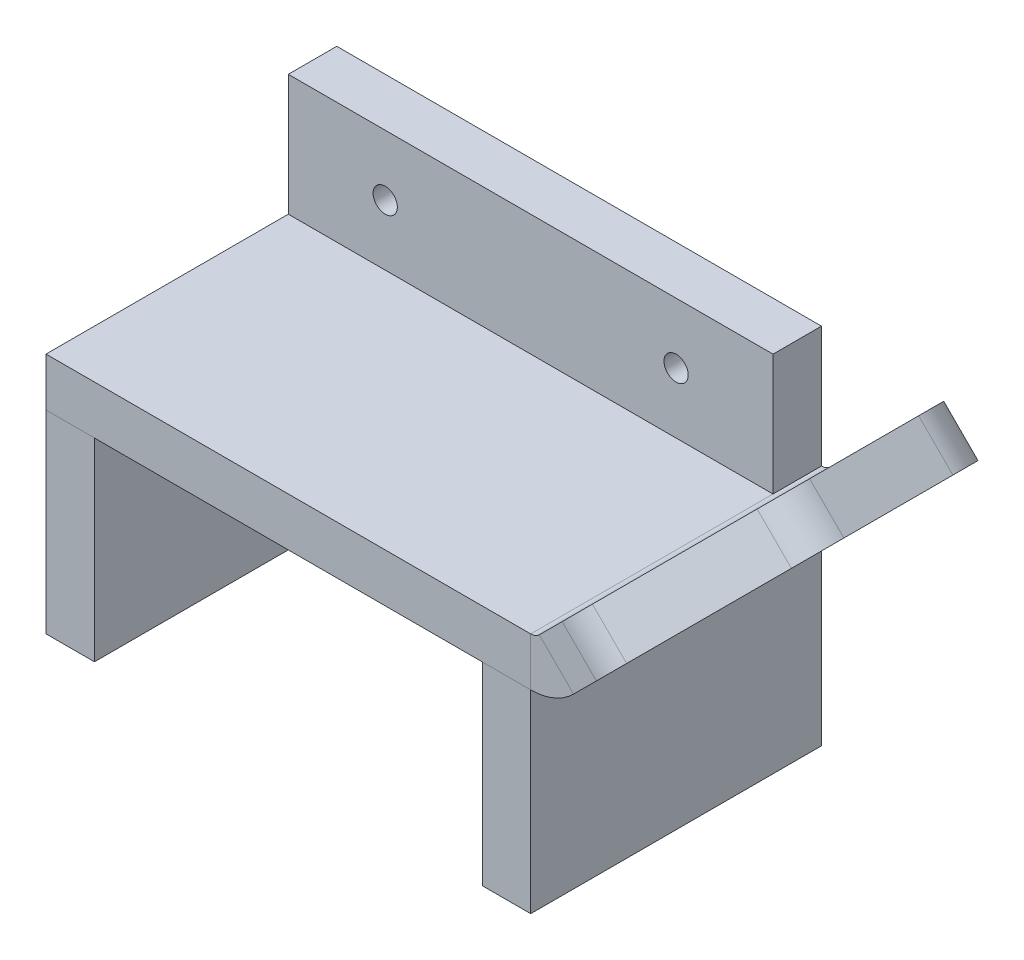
ISO-10303-21;
HEADER;
FILE_DESCRIPTION(('STEP AP214'),'2;1');
FILE_NAME('part.step','',(''),(''),'','','');
FILE_SCHEMA(('AUTOMOTIVE_DESIGN { 1 0 10303 214 1 1 1 1 }'));
ENDSEC;
DATA;
#1=APPLICATION_CONTEXT('core data for automotive mechanical design processes');
#2=APPLICATION_PROTOCOL_DEFINITION('international standard','automotive_design',2000,#1);
#3=PRODUCT_CONTEXT('',#1,'mechanical');
#4=PRODUCT('Part','Part','',(#3));
#5=PRODUCT_RELATED_PRODUCT_CATEGORY('part','',(#4));
#6=PRODUCT_DEFINITION_FORMATION('','',#4);
#7=PRODUCT_DEFINITION_CONTEXT('part definition',#1,'design');
#8=PRODUCT_DEFINITION('design','',#6,#7);
#9=PRODUCT_DEFINITION_SHAPE('','',#8);
#10=(LENGTH_UNIT() NAMED_UNIT(*) SI_UNIT(.MILLI.,.METRE.));
#11=(NAMED_UNIT(*) PLANE_ANGLE_UNIT() SI_UNIT($,.RADIAN.));
#12=(NAMED_UNIT(*) SI_UNIT($,.STERADIAN.) SOLID_ANGLE_UNIT());
#13=UNCERTAINTY_MEASURE_WITH_UNIT(LENGTH_MEASURE(1.E-05),#10,'distance_accuracy_value','');
#14=(GEOMETRIC_REPRESENTATION_CONTEXT(3) GLOBAL_UNCERTAINTY_ASSIGNED_CONTEXT((#13)) GLOBAL_UNIT_ASSIGNED_CONTEXT((#10,
#11,#12)) REPRESENTATION_CONTEXT('',''));
#15=CARTESIAN_POINT('',(0.,0.,0.));
#16=DIRECTION('',(0.,0.,1.));
#17=DIRECTION('',(1.,0.,0.));
#18=AXIS2_PLACEMENT_3D('',#15,#16,#17);
#19=CARTESIAN_POINT('',(63.2743596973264,1187.45,-76.2));
#20=DIRECTION('',(-1.,0.,0.));
#21=DIRECTION('',(0.,0.,1.));
#22=AXIS2_PLACEMENT_3D('',#19,#20,#21);
#23=PLANE('',#22);
#24=DIRECTION('',(0.,0.,-1.));
#25=VECTOR('',#24,1.);
#26=CARTESIAN_POINT('',(63.2743596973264,1155.7,-76.2));
#27=LINE('',#26,#25);
#28=CARTESIAN_POINT('',(63.2743596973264,1155.7,-63.5));
#29=VERTEX_POINT('',#28);
#30=CARTESIAN_POINT('',(63.2743596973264,1155.7,-76.2));
#31=VERTEX_POINT('',#30);
#32=EDGE_CURVE('E124',#29,#31,#27,.T.);
#33=ORIENTED_EDGE('',*,*,#32,.T.);
#34=DIRECTION('',(0.,-1.,0.));
#35=VECTOR('',#34,1.);
#36=CARTESIAN_POINT('',(63.2743596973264,1187.45,-76.2));
#37=LINE('',#36,#35);
#38=CARTESIAN_POINT('',(63.2743596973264,1187.45,-76.2));
#39=VERTEX_POINT('',#38);
#40=EDGE_CURVE('E12',#39,#31,#37,.T.);
#41=ORIENTED_EDGE('',*,*,#40,.F.);
#42=DIRECTION('',(0.,0.,-1.));
#43=VECTOR('',#42,1.);
#44=CARTESIAN_POINT('',(63.2743596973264,1187.45,-76.2));
#45=LINE('',#44,#43);
#46=CARTESIAN_POINT('',(63.2743596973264,1187.45,-63.5));
#47=VERTEX_POINT('',#46);
#48=EDGE_CURVE('E111',#47,#39,#45,.T.);
#49=ORIENTED_EDGE('',*,*,#48,.F.);
#50=DIRECTION('',(0.,-1.,0.));
#51=VECTOR('',#50,1.);
#52=CARTESIAN_POINT('',(63.2743596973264,1187.45,-63.5));
#53=LINE('',#52,#51);
#54=EDGE_CURVE('E120',#47,#29,#53,.T.);
#55=ORIENTED_EDGE('',*,*,#54,.T.);
#56=EDGE_LOOP('',(#33,#41,#49,#55));
#57=FACE_BOUND('',#56,.T.);
#58=ADVANCED_FACE('F58',(#57),#23,.F.);
#59=CARTESIAN_POINT('',(63.2743596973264,1187.45,-76.2));
#60=DIRECTION('',(0.,0.,1.));
#61=DIRECTION('',(1.,0.,0.));
#62=AXIS2_PLACEMENT_3D('',#59,#60,#61);
#63=PLANE('',#62);
#64=CARTESIAN_POINT('',(37.8743596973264,1171.575,-76.2));
#65=DIRECTION('',(0.,0.,-1.));
#66=DIRECTION('',(-1.,0.,0.));
#67=AXIS2_PLACEMENT_3D('',#64,#65,#66);
#68=CIRCLE('',#67,3.17500000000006);
#69=CARTESIAN_POINT('',(34.6993596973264,1171.575,-76.2));
#70=VERTEX_POINT('',#69);
#71=EDGE_CURVE('E133',#70,#70,#68,.T.);
#72=ORIENTED_EDGE('',*,*,#71,.F.);
#73=EDGE_LOOP('',(#72));
#74=FACE_BOUND('',#73,.T.);
#75=CARTESIAN_POINT('',(-38.354,1171.575,-76.2));
#76=DIRECTION('',(0.,0.,-1.));
#77=DIRECTION('',(-1.,0.,0.));
#78=AXIS2_PLACEMENT_3D('',#75,#76,#77);
#79=CIRCLE('',#78,3.17500000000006);
#80=CARTESIAN_POINT('',(-41.5290000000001,1171.575,-76.2));
#81=VERTEX_POINT('',#80);
#82=EDGE_CURVE('E138',#81,#81,#79,.T.);
#83=ORIENTED_EDGE('',*,*,#82,.F.);
#84=EDGE_LOOP('',(#83));
#85=FACE_BOUND('',#84,.T.);
#86=DIRECTION('',(-1.,0.,0.));
#87=VECTOR('',#86,1.);
#88=CARTESIAN_POINT('',(63.2743596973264,1155.7,-76.2));
#89=LINE('',#88,#87);
#90=CARTESIAN_POINT('',(-63.754,1155.7,-76.2));
#91=VERTEX_POINT('',#90);
#92=EDGE_CURVE('E115',#31,#91,#89,.T.);
#93=ORIENTED_EDGE('',*,*,#92,.T.);
#94=DIRECTION('',(0.,-1.,0.));
#95=VECTOR('',#94,1.);
#96=CARTESIAN_POINT('',(-63.754,1187.45,-76.2));
#97=LINE('',#96,#95);
#98=CARTESIAN_POINT('',(-63.754,1187.45,-76.2));
#99=VERTEX_POINT('',#98);
#100=EDGE_CURVE('E67',#99,#91,#97,.T.);
#101=ORIENTED_EDGE('',*,*,#100,.F.);
#102=DIRECTION('',(-1.,0.,0.));
#103=VECTOR('',#102,1.);
#104=CARTESIAN_POINT('',(63.2743596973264,1187.45,-76.2));
#105=LINE('',#104,#103);
#106=EDGE_CURVE('E106',#39,#99,#105,.T.);
#107=ORIENTED_EDGE('',*,*,#106,.F.);
#108=ORIENTED_EDGE('',*,*,#40,.T.);
#109=EDGE_LOOP('',(#93,#101,#107,#108));
#110=FACE_BOUND('',#109,.T.);
#111=ADVANCED_FACE('F114',(#74,#85,#110),#63,.F.);
#112=CARTESIAN_POINT('',(-63.754,1187.45,-76.2));
#113=DIRECTION('',(1.,0.,0.));
#114=DIRECTION('',(0.,0.,-1.));
#115=AXIS2_PLACEMENT_3D('',#112,#113,#114);
#116=PLANE('',#115);
#117=DIRECTION('',(0.,0.,1.));
#118=VECTOR('',#117,1.);
#119=CARTESIAN_POINT('',(-63.754,1155.7,-76.2));
#120=LINE('',#119,#118);
#121=CARTESIAN_POINT('',(-63.754,1155.7,-63.5));
#122=VERTEX_POINT('',#121);
#123=EDGE_CURVE('E93',#91,#122,#120,.T.);
#124=ORIENTED_EDGE('',*,*,#123,.T.);
#125=DIRECTION('',(0.,-1.,0.));
#126=VECTOR('',#125,1.);
#127=CARTESIAN_POINT('',(-63.754,1187.45,-63.5));
#128=LINE('',#127,#126);
#129=CARTESIAN_POINT('',(-63.754,1187.45,-63.5));
#130=VERTEX_POINT('',#129);
#131=EDGE_CURVE('E116',#130,#122,#128,.T.);
#132=ORIENTED_EDGE('',*,*,#131,.F.);
#133=DIRECTION('',(0.,0.,1.));
#134=VECTOR('',#133,1.);
#135=CARTESIAN_POINT('',(-63.754,1187.45,-76.2));
#136=LINE('',#135,#134);
#137=EDGE_CURVE('E109',#99,#130,#136,.T.);
#138=ORIENTED_EDGE('',*,*,#137,.F.);
#139=ORIENTED_EDGE('',*,*,#100,.T.);
#140=EDGE_LOOP('',(#124,#132,#138,#139));
#141=FACE_BOUND('',#140,.T.);
#142=ADVANCED_FACE('F118',(#141),#116,.F.);
#143=CARTESIAN_POINT('',(63.2743596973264,1187.45,-63.5));
#144=DIRECTION('',(0.,0.,-1.));
#145=DIRECTION('',(-1.,0.,0.));
#146=AXIS2_PLACEMENT_3D('',#143,#144,#145);
#147=PLANE('',#146);
#148=CARTESIAN_POINT('',(37.8743596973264,1171.575,-63.5));
#149=DIRECTION('',(0.,0.,-1.));
#150=DIRECTION('',(-1.,0.,0.));
#151=AXIS2_PLACEMENT_3D('',#148,#149,#150);
#152=CIRCLE('',#151,3.17500000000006);
#153=CARTESIAN_POINT('',(34.6993596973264,1171.575,-63.5));
#154=VERTEX_POINT('',#153);
#155=EDGE_CURVE('E61',#154,#154,#152,.T.);
#156=ORIENTED_EDGE('',*,*,#155,.T.);
#157=EDGE_LOOP('',(#156));
#158=FACE_BOUND('',#157,.T.);
#159=CARTESIAN_POINT('',(-38.354,1171.575,-63.5));
#160=DIRECTION('',(0.,0.,-1.));
#161=DIRECTION('',(-1.,0.,0.));
#162=AXIS2_PLACEMENT_3D('',#159,#160,#161);
#163=CIRCLE('',#162,3.17500000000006);
#164=CARTESIAN_POINT('',(-41.5290000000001,1171.575,-63.5));
#165=VERTEX_POINT('',#164);
#166=EDGE_CURVE('E131',#165,#165,#163,.T.);
#167=ORIENTED_EDGE('',*,*,#166,.T.);
#168=EDGE_LOOP('',(#167));
#169=FACE_BOUND('',#168,.T.);
#170=DIRECTION('',(1.,0.,0.));
#171=VECTOR('',#170,1.);
#172=CARTESIAN_POINT('',(63.2743596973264,1155.7,-63.5));
#173=LINE('',#172,#171);
#174=EDGE_CURVE('E99',#122,#29,#173,.T.);
#175=ORIENTED_EDGE('',*,*,#174,.T.);
#176=ORIENTED_EDGE('',*,*,#54,.F.);
#177=DIRECTION('',(1.,0.,0.));
#178=VECTOR('',#177,1.);
#179=CARTESIAN_POINT('',(63.2743596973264,1187.45,-63.5));
#180=LINE('',#179,#178);
#181=EDGE_CURVE('E76',#130,#47,#180,.T.);
#182=ORIENTED_EDGE('',*,*,#181,.F.);
#183=ORIENTED_EDGE('',*,*,#131,.T.);
#184=EDGE_LOOP('',(#175,#176,#182,#183));
#185=FACE_BOUND('',#184,.T.);
#186=ADVANCED_FACE('F155',(#158,#169,#185),#147,.F.);
#187=CARTESIAN_POINT('',(0.,1187.45,0.));
#188=DIRECTION('',(0.,-1.,0.));
#189=DIRECTION('',(0.,0.,-1.));
#190=AXIS2_PLACEMENT_3D('',#187,#188,#189);
#191=PLANE('',#190);
#192=ORIENTED_EDGE('',*,*,#48,.T.);
#193=ORIENTED_EDGE('',*,*,#106,.T.);
#194=ORIENTED_EDGE('',*,*,#137,.T.);
#195=ORIENTED_EDGE('',*,*,#181,.T.);
#196=EDGE_LOOP('',(#192,#193,#194,#195));
#197=FACE_BOUND('',#196,.T.);
#198=ADVANCED_FACE('F107',(#197),#191,.F.);
#199=CARTESIAN_POINT('',(0.,1155.7,0.));
#200=DIRECTION('',(0.,-1.,0.));
#201=DIRECTION('',(0.,0.,-1.));
#202=AXIS2_PLACEMENT_3D('',#199,#200,#201);
#203=PLANE('',#202);
#204=ORIENTED_EDGE('',*,*,#32,.F.);
#205=ORIENTED_EDGE('',*,*,#174,.F.);
#206=ORIENTED_EDGE('',*,*,#123,.F.);
#207=ORIENTED_EDGE('',*,*,#92,.F.);
#208=EDGE_LOOP('',(#204,#205,#206,#207));
#209=FACE_BOUND('',#208,.T.);
#210=ADVANCED_FACE('F162',(#209),#203,.T.);
#211=CARTESIAN_POINT('',(-38.354,1171.575,0.));
#212=DIRECTION('',(0.,0.,-1.));
#213=DIRECTION('',(-1.,0.,0.));
#214=AXIS2_PLACEMENT_3D('',#211,#212,#213);
#215=CYLINDRICAL_SURFACE('',#214,3.17500000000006);
#216=CARTESIAN_POINT('',(-41.5290000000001,1171.575,-76.2));
#217=CARTESIAN_POINT('',(-41.5290000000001,1171.575,-76.0677083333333));
#218=CARTESIAN_POINT('',(-41.5290000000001,1171.575,-75.9354166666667));
#219=CARTESIAN_POINT('',(-41.5290000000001,1171.575,-75.6708333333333));
#220=CARTESIAN_POINT('',(-41.5290000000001,1171.575,-75.5385416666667));
#221=CARTESIAN_POINT('',(-41.5290000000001,1171.575,-75.2739583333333));
#222=CARTESIAN_POINT('',(-41.5290000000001,1171.575,-75.1416666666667));
#223=CARTESIAN_POINT('',(-41.5290000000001,1171.575,-74.8770833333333));
#224=CARTESIAN_POINT('',(-41.5290000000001,1171.575,-74.7447916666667));
#225=CARTESIAN_POINT('',(-41.5290000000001,1171.575,-74.4802083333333));
#226=CARTESIAN_POINT('',(-41.5290000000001,1171.575,-74.3479166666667));
#227=CARTESIAN_POINT('',(-41.5290000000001,1171.575,-74.0833333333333));
#228=CARTESIAN_POINT('',(-41.5290000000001,1171.575,-73.9510416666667));
#229=CARTESIAN_POINT('',(-41.5290000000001,1171.575,-73.6864583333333));
#230=CARTESIAN_POINT('',(-41.5290000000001,1171.575,-73.5541666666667));
#231=CARTESIAN_POINT('',(-41.5290000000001,1171.575,-73.2895833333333));
#232=CARTESIAN_POINT('',(-41.5290000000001,1171.575,-73.1572916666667));
#233=CARTESIAN_POINT('',(-41.5290000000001,1171.575,-72.8927083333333));
#234=CARTESIAN_POINT('',(-41.5290000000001,1171.575,-72.7604166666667));
#235=CARTESIAN_POINT('',(-41.5290000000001,1171.575,-72.4958333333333));
#236=CARTESIAN_POINT('',(-41.5290000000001,1171.575,-72.3635416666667));
#237=CARTESIAN_POINT('',(-41.5290000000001,1171.575,-72.0989583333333));
#238=CARTESIAN_POINT('',(-41.5290000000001,1171.575,-71.9666666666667));
#239=CARTESIAN_POINT('',(-41.5290000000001,1171.575,-71.7020833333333));
#240=CARTESIAN_POINT('',(-41.5290000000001,1171.575,-71.5697916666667));
#241=CARTESIAN_POINT('',(-41.5290000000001,1171.575,-71.3052083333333));
#242=CARTESIAN_POINT('',(-41.5290000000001,1171.575,-71.1729166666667));
#243=CARTESIAN_POINT('',(-41.5290000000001,1171.575,-70.9083333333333));
#244=CARTESIAN_POINT('',(-41.5290000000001,1171.575,-70.7760416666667));
#245=CARTESIAN_POINT('',(-41.5290000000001,1171.575,-70.5114583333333));
#246=CARTESIAN_POINT('',(-41.5290000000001,1171.575,-70.3791666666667));
#247=CARTESIAN_POINT('',(-41.5290000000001,1171.575,-70.1145833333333));
#248=CARTESIAN_POINT('',(-41.5290000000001,1171.575,-69.9822916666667));
#249=CARTESIAN_POINT('',(-41.5290000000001,1171.575,-69.7177083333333));
#250=CARTESIAN_POINT('',(-41.5290000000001,1171.575,-69.5854166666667));
#251=CARTESIAN_POINT('',(-41.5290000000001,1171.575,-69.3208333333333));
#252=CARTESIAN_POINT('',(-41.5290000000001,1171.575,-69.1885416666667));
#253=CARTESIAN_POINT('',(-41.5290000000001,1171.575,-68.9239583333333));
#254=CARTESIAN_POINT('',(-41.5290000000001,1171.575,-68.7916666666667));
#255=CARTESIAN_POINT('',(-41.5290000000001,1171.575,-68.5270833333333));
#256=CARTESIAN_POINT('',(-41.5290000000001,1171.575,-68.3947916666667));
#257=CARTESIAN_POINT('',(-41.5290000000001,1171.575,-68.1302083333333));
#258=CARTESIAN_POINT('',(-41.5290000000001,1171.575,-67.9979166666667));
#259=CARTESIAN_POINT('',(-41.5290000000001,1171.575,-67.7333333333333));
#260=CARTESIAN_POINT('',(-41.5290000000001,1171.575,-67.6010416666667));
#261=CARTESIAN_POINT('',(-41.5290000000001,1171.575,-67.3364583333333));
#262=CARTESIAN_POINT('',(-41.5290000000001,1171.575,-67.2041666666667));
#263=CARTESIAN_POINT('',(-41.5290000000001,1171.575,-66.9395833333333));
#264=CARTESIAN_POINT('',(-41.5290000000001,1171.575,-66.8072916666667));
#265=CARTESIAN_POINT('',(-41.5290000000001,1171.575,-66.5427083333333));
#266=CARTESIAN_POINT('',(-41.5290000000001,1171.575,-66.4104166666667));
#267=CARTESIAN_POINT('',(-41.5290000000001,1171.575,-66.1458333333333));
#268=CARTESIAN_POINT('',(-41.5290000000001,1171.575,-66.0135416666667));
#269=CARTESIAN_POINT('',(-41.5290000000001,1171.575,-65.7489583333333));
#270=CARTESIAN_POINT('',(-41.5290000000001,1171.575,-65.6166666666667));
#271=CARTESIAN_POINT('',(-41.5290000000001,1171.575,-65.3520833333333));
#272=CARTESIAN_POINT('',(-41.5290000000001,1171.575,-65.2197916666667));
#273=CARTESIAN_POINT('',(-41.5290000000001,1171.575,-64.9552083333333));
#274=CARTESIAN_POINT('',(-41.5290000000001,1171.575,-64.8229166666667));
#275=CARTESIAN_POINT('',(-41.5290000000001,1171.575,-64.5583333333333));
#276=CARTESIAN_POINT('',(-41.5290000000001,1171.575,-64.4260416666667));
#277=CARTESIAN_POINT('',(-41.5290000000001,1171.575,-64.1614583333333));
#278=CARTESIAN_POINT('',(-41.5290000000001,1171.575,-64.0291666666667));
#279=CARTESIAN_POINT('',(-41.5290000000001,1171.575,-63.7645833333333));
#280=CARTESIAN_POINT('',(-41.5290000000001,1171.575,-63.6322916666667));
#281=CARTESIAN_POINT('',(-41.5290000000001,1171.575,-63.5));
#282=B_SPLINE_CURVE_WITH_KNOTS('',3,(#216,#217,#218,#219,#220,#221,#222,#223,#224,#225,#226,
#227,#228,#229,#230,#231,#232,#233,#234,#235,#236,#237,#238,#239,#240,#241,#242,#243,#244,#245,
#246,#247,#248,#249,#250,#251,#252,#253,#254,#255,#256,#257,#258,#259,#260,#261,#262,#263,#264,
#265,#266,#267,#268,#269,#270,#271,#272,#273,#274,#275,#276,#277,#278,#279,#280,#281),
.UNSPECIFIED.,.F.,.F.,(4,2,2,2,2,2,2,2,2,2,2,2,2,2,2,2,2,2,2,2,2,2,2,2,2,2,2,2,2,2,2,2,4),(0.,
0.396875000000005,0.793749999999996,1.190625,1.58750000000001,1.984375,2.38125,2.77812500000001,
3.17500000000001,3.571875,3.96875000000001,4.36562500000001,4.7625,5.15937500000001,
5.55625000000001,5.953125,6.35000000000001,6.74687500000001,7.14375,7.54062500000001,
7.93750000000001,8.334375,8.73125000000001,9.12812500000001,9.52500000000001,9.92187500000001,
10.31875,10.715625,11.1125,11.509375,11.90625,12.303125,12.7),.UNSPECIFIED.);
#283=EDGE_CURVE('BSEAM146',#81,#165,#282,.T.);
#284=ORIENTED_EDGE('',*,*,#82,.T.);
#285=ORIENTED_EDGE('',*,*,#166,.F.);
#286=ORIENTED_EDGE('',*,*,#283,.T.);
#287=ORIENTED_EDGE('',*,*,#283,.F.);
#288=EDGE_LOOP('',(#284,#286,#285,#287));
#289=FACE_BOUND('',#288,.T.);
#290=ADVANCED_FACE('F146',(#289),#215,.F.);
#291=CARTESIAN_POINT('',(37.8743596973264,1171.575,0.));
#292=DIRECTION('',(0.,0.,-1.));
#293=DIRECTION('',(-1.,0.,0.));
#294=AXIS2_PLACEMENT_3D('',#291,#292,#293);
#295=CYLINDRICAL_SURFACE('',#294,3.17500000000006);
#296=CARTESIAN_POINT('',(34.6993596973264,1171.575,-76.2));
#297=CARTESIAN_POINT('',(34.6993596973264,1171.575,-76.0677083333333));
#298=CARTESIAN_POINT('',(34.6993596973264,1171.575,-75.9354166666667));
#299=CARTESIAN_POINT('',(34.6993596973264,1171.575,-75.6708333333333));
#300=CARTESIAN_POINT('',(34.6993596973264,1171.575,-75.5385416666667));
#301=CARTESIAN_POINT('',(34.6993596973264,1171.575,-75.2739583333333));
#302=CARTESIAN_POINT('',(34.6993596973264,1171.575,-75.1416666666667));
#303=CARTESIAN_POINT('',(34.6993596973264,1171.575,-74.8770833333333));
#304=CARTESIAN_POINT('',(34.6993596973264,1171.575,-74.7447916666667));
#305=CARTESIAN_POINT('',(34.6993596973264,1171.575,-74.4802083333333));
#306=CARTESIAN_POINT('',(34.6993596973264,1171.575,-74.3479166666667));
#307=CARTESIAN_POINT('',(34.6993596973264,1171.575,-74.0833333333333));
#308=CARTESIAN_POINT('',(34.6993596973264,1171.575,-73.9510416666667));
#309=CARTESIAN_POINT('',(34.6993596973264,1171.575,-73.6864583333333));
#310=CARTESIAN_POINT('',(34.6993596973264,1171.575,-73.5541666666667));
#311=CARTESIAN_POINT('',(34.6993596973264,1171.575,-73.2895833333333));
#312=CARTESIAN_POINT('',(34.6993596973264,1171.575,-73.1572916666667));
#313=CARTESIAN_POINT('',(34.6993596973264,1171.575,-72.8927083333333));
#314=CARTESIAN_POINT('',(34.6993596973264,1171.575,-72.7604166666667));
#315=CARTESIAN_POINT('',(34.6993596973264,1171.575,-72.4958333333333));
#316=CARTESIAN_POINT('',(34.6993596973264,1171.575,-72.3635416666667));
#317=CARTESIAN_POINT('',(34.6993596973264,1171.575,-72.0989583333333));
#318=CARTESIAN_POINT('',(34.6993596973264,1171.575,-71.9666666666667));
#319=CARTESIAN_POINT('',(34.6993596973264,1171.575,-71.7020833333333));
#320=CARTESIAN_POINT('',(34.6993596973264,1171.575,-71.5697916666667));
#321=CARTESIAN_POINT('',(34.6993596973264,1171.575,-71.3052083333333));
#322=CARTESIAN_POINT('',(34.6993596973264,1171.575,-71.1729166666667));
#323=CARTESIAN_POINT('',(34.6993596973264,1171.575,-70.9083333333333));
#324=CARTESIAN_POINT('',(34.6993596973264,1171.575,-70.7760416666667));
#325=CARTESIAN_POINT('',(34.6993596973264,1171.575,-70.5114583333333));
#326=CARTESIAN_POINT('',(34.6993596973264,1171.575,-70.3791666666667));
#327=CARTESIAN_POINT('',(34.6993596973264,1171.575,-70.1145833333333));
#328=CARTESIAN_POINT('',(34.6993596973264,1171.575,-69.9822916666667));
#329=CARTESIAN_POINT('',(34.6993596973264,1171.575,-69.7177083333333));
#330=CARTESIAN_POINT('',(34.6993596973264,1171.575,-69.5854166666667));
#331=CARTESIAN_POINT('',(34.6993596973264,1171.575,-69.3208333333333));
#332=CARTESIAN_POINT('',(34.6993596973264,1171.575,-69.1885416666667));
#333=CARTESIAN_POINT('',(34.6993596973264,1171.575,-68.9239583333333));
#334=CARTESIAN_POINT('',(34.6993596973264,1171.575,-68.7916666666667));
#335=CARTESIAN_POINT('',(34.6993596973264,1171.575,-68.5270833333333));
#336=CARTESIAN_POINT('',(34.6993596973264,1171.575,-68.3947916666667));
#337=CARTESIAN_POINT('',(34.6993596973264,1171.575,-68.1302083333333));
#338=CARTESIAN_POINT('',(34.6993596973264,1171.575,-67.9979166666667));
#339=CARTESIAN_POINT('',(34.6993596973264,1171.575,-67.7333333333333));
#340=CARTESIAN_POINT('',(34.6993596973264,1171.575,-67.6010416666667));
#341=CARTESIAN_POINT('',(34.6993596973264,1171.575,-67.3364583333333));
#342=CARTESIAN_POINT('',(34.6993596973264,1171.575,-67.2041666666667));
#343=CARTESIAN_POINT('',(34.6993596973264,1171.575,-66.9395833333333));
#344=CARTESIAN_POINT('',(34.6993596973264,1171.575,-66.8072916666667));
#345=CARTESIAN_POINT('',(34.6993596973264,1171.575,-66.5427083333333));
#346=CARTESIAN_POINT('',(34.6993596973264,1171.575,-66.4104166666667));
#347=CARTESIAN_POINT('',(34.6993596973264,1171.575,-66.1458333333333));
#348=CARTESIAN_POINT('',(34.6993596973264,1171.575,-66.0135416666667));
#349=CARTESIAN_POINT('',(34.6993596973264,1171.575,-65.7489583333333));
#350=CARTESIAN_POINT('',(34.6993596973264,1171.575,-65.6166666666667));
#351=CARTESIAN_POINT('',(34.6993596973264,1171.575,-65.3520833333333));
#352=CARTESIAN_POINT('',(34.6993596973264,1171.575,-65.2197916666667));
#353=CARTESIAN_POINT('',(34.6993596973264,1171.575,-64.9552083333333));
#354=CARTESIAN_POINT('',(34.6993596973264,1171.575,-64.8229166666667));
#355=CARTESIAN_POINT('',(34.6993596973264,1171.575,-64.5583333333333));
#356=CARTESIAN_POINT('',(34.6993596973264,1171.575,-64.4260416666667));
#357=CARTESIAN_POINT('',(34.6993596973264,1171.575,-64.1614583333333));
#358=CARTESIAN_POINT('',(34.6993596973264,1171.575,-64.0291666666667));
#359=CARTESIAN_POINT('',(34.6993596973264,1171.575,-63.7645833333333));
#360=CARTESIAN_POINT('',(34.6993596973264,1171.575,-63.6322916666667));
#361=CARTESIAN_POINT('',(34.6993596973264,1171.575,-63.5));
#362=B_SPLINE_CURVE_WITH_KNOTS('',3,(#296,#297,#298,#299,#300,#301,#302,#303,#304,#305,#306,
#307,#308,#309,#310,#311,#312,#313,#314,#315,#316,#317,#318,#319,#320,#321,#322,#323,#324,#325,
#326,#327,#328,#329,#330,#331,#332,#333,#334,#335,#336,#337,#338,#339,#340,#341,#342,#343,#344,
#345,#346,#347,#348,#349,#350,#351,#352,#353,#354,#355,#356,#357,#358,#359,#360,#361),
.UNSPECIFIED.,.F.,.F.,(4,2,2,2,2,2,2,2,2,2,2,2,2,2,2,2,2,2,2,2,2,2,2,2,2,2,2,2,2,2,2,2,4),(0.,
0.396875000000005,0.793749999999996,1.190625,1.58750000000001,1.984375,2.38125,2.77812500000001,
3.17500000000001,3.571875,3.96875000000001,4.36562500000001,4.7625,5.15937500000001,
5.55625000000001,5.953125,6.35000000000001,6.74687500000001,7.14375,7.54062500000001,
7.93750000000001,8.334375,8.73125000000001,9.12812500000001,9.52500000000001,9.92187500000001,
10.31875,10.715625,11.1125,11.509375,11.90625,12.303125,12.7),.UNSPECIFIED.);
#363=EDGE_CURVE('BSEAM170',#70,#154,#362,.T.);
#364=ORIENTED_EDGE('',*,*,#71,.T.);
#365=ORIENTED_EDGE('',*,*,#155,.F.);
#366=ORIENTED_EDGE('',*,*,#363,.T.);
#367=ORIENTED_EDGE('',*,*,#363,.F.);
#368=EDGE_LOOP('',(#364,#366,#365,#367));
#369=FACE_BOUND('',#368,.T.);
#370=ADVANCED_FACE('F170',(#369),#295,.F.);
#371=CLOSED_SHELL('',(#58,#111,#142,#186,#198,#210,#290,#370));
#372=MANIFOLD_SOLID_BREP('B2',#371);
#373=CARTESIAN_POINT('',(63.274359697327,1092.2,0.));
#374=DIRECTION('',(-1.,0.,0.));
#375=DIRECTION('',(0.,0.,1.));
#376=AXIS2_PLACEMENT_3D('',#373,#374,#375);
#377=PLANE('',#376);
#378=DIRECTION('',(0.,0.,1.));
#379=VECTOR('',#378,1.);
#380=CARTESIAN_POINT('',(63.274359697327,1143.,0.));
#381=LINE('',#380,#379);
#382=CARTESIAN_POINT('',(63.274359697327,1143.,-76.2));
#383=VERTEX_POINT('',#382);
#384=CARTESIAN_POINT('',(63.274359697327,1143.,0.));
#385=VERTEX_POINT('',#384);
#386=EDGE_CURVE('E296',#383,#385,#381,.T.);
#387=ORIENTED_EDGE('',*,*,#386,.T.);
#388=DIRECTION('',(0.,1.,0.));
#389=VECTOR('',#388,1.);
#390=CARTESIAN_POINT('',(63.274359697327,1092.2,0.));
#391=LINE('',#390,#389);
#392=CARTESIAN_POINT('',(63.274359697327,1092.2,0.));
#393=VERTEX_POINT('',#392);
#394=EDGE_CURVE('E56',#393,#385,#391,.T.);
#395=ORIENTED_EDGE('',*,*,#394,.F.);
#396=DIRECTION('',(0.,0.,1.));
#397=VECTOR('',#396,1.);
#398=CARTESIAN_POINT('',(63.274359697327,1092.2,0.));
#399=LINE('',#398,#397);
#400=CARTESIAN_POINT('',(63.274359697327,1092.2,-76.2));
#401=VERTEX_POINT('',#400);
#402=EDGE_CURVE('E284',#401,#393,#399,.T.);
#403=ORIENTED_EDGE('',*,*,#402,.F.);
#404=DIRECTION('',(0.,1.,0.));
#405=VECTOR('',#404,1.);
#406=CARTESIAN_POINT('',(63.274359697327,1092.2,-76.2));
#407=LINE('',#406,#405);
#408=EDGE_CURVE('E292',#401,#383,#407,.T.);
#409=ORIENTED_EDGE('',*,*,#408,.T.);
#410=EDGE_LOOP('',(#387,#395,#403,#409));
#411=FACE_BOUND('',#410,.T.);
#412=ADVANCED_FACE('F233',(#411),#377,.F.);
#413=CARTESIAN_POINT('',(63.274359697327,1092.2,0.));
#414=DIRECTION('',(0.,0.,-1.));
#415=DIRECTION('',(-1.,0.,0.));
#416=AXIS2_PLACEMENT_3D('',#413,#414,#415);
#417=PLANE('',#416);
#418=DIRECTION('',(-1.,0.,0.));
#419=VECTOR('',#418,1.);
#420=CARTESIAN_POINT('',(63.274359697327,1143.,0.));
#421=LINE('',#420,#419);
#422=CARTESIAN_POINT('',(50.574359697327,1143.,0.));
#423=VERTEX_POINT('',#422);
#424=EDGE_CURVE('E288',#385,#423,#421,.T.);
#425=ORIENTED_EDGE('',*,*,#424,.T.);
#426=DIRECTION('',(0.,1.,0.));
#427=VECTOR('',#426,1.);
#428=CARTESIAN_POINT('',(50.574359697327,1092.2,0.));
#429=LINE('',#428,#427);
#430=CARTESIAN_POINT('',(50.574359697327,1092.2,0.));
#431=VERTEX_POINT('',#430);
#432=EDGE_CURVE('E241',#431,#423,#429,.T.);
#433=ORIENTED_EDGE('',*,*,#432,.F.);
#434=DIRECTION('',(-1.,0.,0.));
#435=VECTOR('',#434,1.);
#436=CARTESIAN_POINT('',(63.274359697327,1092.2,0.));
#437=LINE('',#436,#435);
#438=EDGE_CURVE('E279',#393,#431,#437,.T.);
#439=ORIENTED_EDGE('',*,*,#438,.F.);
#440=ORIENTED_EDGE('',*,*,#394,.T.);
#441=EDGE_LOOP('',(#425,#433,#439,#440));
#442=FACE_BOUND('',#441,.T.);
#443=ADVANCED_FACE('F287',(#442),#417,.F.);
#444=CARTESIAN_POINT('',(50.574359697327,1092.2,0.));
#445=DIRECTION('',(1.,0.,0.));
#446=DIRECTION('',(0.,0.,-1.));
#447=AXIS2_PLACEMENT_3D('',#444,#445,#446);
#448=PLANE('',#447);
#449=DIRECTION('',(0.,0.,-1.));
#450=VECTOR('',#449,1.);
#451=CARTESIAN_POINT('',(50.574359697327,1143.,0.));
#452=LINE('',#451,#450);
#453=CARTESIAN_POINT('',(50.574359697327,1143.,-76.2));
#454=VERTEX_POINT('',#453);
#455=EDGE_CURVE('E266',#423,#454,#452,.T.);
#456=ORIENTED_EDGE('',*,*,#455,.T.);
#457=DIRECTION('',(0.,1.,0.));
#458=VECTOR('',#457,1.);
#459=CARTESIAN_POINT('',(50.574359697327,1092.2,-76.2));
#460=LINE('',#459,#458);
#461=CARTESIAN_POINT('',(50.574359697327,1092.2,-76.2));
#462=VERTEX_POINT('',#461);
#463=EDGE_CURVE('E289',#462,#454,#460,.T.);
#464=ORIENTED_EDGE('',*,*,#463,.F.);
#465=DIRECTION('',(0.,0.,-1.));
#466=VECTOR('',#465,1.);
#467=CARTESIAN_POINT('',(50.574359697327,1092.2,0.));
#468=LINE('',#467,#466);
#469=EDGE_CURVE('E282',#431,#462,#468,.T.);
#470=ORIENTED_EDGE('',*,*,#469,.F.);
#471=ORIENTED_EDGE('',*,*,#432,.T.);
#472=EDGE_LOOP('',(#456,#464,#470,#471));
#473=FACE_BOUND('',#472,.T.);
#474=ADVANCED_FACE('F290',(#473),#448,.F.);
#475=CARTESIAN_POINT('',(63.274359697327,1092.2,-76.2));
#476=DIRECTION('',(0.,0.,1.));
#477=DIRECTION('',(1.,0.,0.));
#478=AXIS2_PLACEMENT_3D('',#475,#476,#477);
#479=PLANE('',#478);
#480=DIRECTION('',(1.,0.,0.));
#481=VECTOR('',#480,1.);
#482=CARTESIAN_POINT('',(63.274359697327,1143.,-76.2));
#483=LINE('',#482,#481);
#484=EDGE_CURVE('E272',#454,#383,#483,.T.);
#485=ORIENTED_EDGE('',*,*,#484,.T.);
#486=ORIENTED_EDGE('',*,*,#408,.F.);
#487=DIRECTION('',(1.,0.,0.));
#488=VECTOR('',#487,1.);
#489=CARTESIAN_POINT('',(63.274359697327,1092.2,-76.2));
#490=LINE('',#489,#488);
#491=EDGE_CURVE('E249',#462,#401,#490,.T.);
#492=ORIENTED_EDGE('',*,*,#491,.F.);
#493=ORIENTED_EDGE('',*,*,#463,.T.);
#494=EDGE_LOOP('',(#485,#486,#492,#493));
#495=FACE_BOUND('',#494,.T.);
#496=ADVANCED_FACE('F303',(#495),#479,.F.);
#497=CARTESIAN_POINT('',(0.,1092.2,0.));
#498=DIRECTION('',(0.,1.,0.));
#499=DIRECTION('',(0.,0.,1.));
#500=AXIS2_PLACEMENT_3D('',#497,#498,#499);
#501=PLANE('',#500);
#502=ORIENTED_EDGE('',*,*,#402,.T.);
#503=ORIENTED_EDGE('',*,*,#438,.T.);
#504=ORIENTED_EDGE('',*,*,#469,.T.);
#505=ORIENTED_EDGE('',*,*,#491,.T.);
#506=EDGE_LOOP('',(#502,#503,#504,#505));
#507=FACE_BOUND('',#506,.T.);
#508=ADVANCED_FACE('F280',(#507),#501,.F.);
#509=CARTESIAN_POINT('',(0.,1143.,0.));
#510=DIRECTION('',(0.,1.,0.));
#511=DIRECTION('',(0.,0.,1.));
#512=AXIS2_PLACEMENT_3D('',#509,#510,#511);
#513=PLANE('',#512);
#514=ORIENTED_EDGE('',*,*,#386,.F.);
#515=ORIENTED_EDGE('',*,*,#484,.F.);
#516=ORIENTED_EDGE('',*,*,#455,.F.);
#517=ORIENTED_EDGE('',*,*,#424,.F.);
#518=EDGE_LOOP('',(#514,#515,#516,#517));
#519=FACE_BOUND('',#518,.T.);
#520=ADVANCED_FACE('F306',(#519),#513,.T.);
#521=CLOSED_SHELL('',(#412,#443,#474,#496,#508,#520));
#522=MANIFOLD_SOLID_BREP('B6',#521);
#523=CARTESIAN_POINT('',(-63.7539999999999,1092.2,0.));
#524=DIRECTION('',(1.,0.,0.));
#525=DIRECTION('',(0.,0.,-1.));
#526=AXIS2_PLACEMENT_3D('',#523,#524,#525);
#527=PLANE('',#526);
#528=DIRECTION('',(0.,0.,-1.));
#529=VECTOR('',#528,1.);
#530=CARTESIAN_POINT('',(-63.7539999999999,1143.,0.));
#531=LINE('',#530,#529);
#532=CARTESIAN_POINT('',(-63.7539999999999,1143.,0.));
#533=VERTEX_POINT('',#532);
#534=CARTESIAN_POINT('',(-63.7539999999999,1143.,-76.2));
#535=VERTEX_POINT('',#534);
#536=EDGE_CURVE('E416',#533,#535,#531,.T.);
#537=ORIENTED_EDGE('',*,*,#536,.T.);
#538=DIRECTION('',(0.,1.,0.));
#539=VECTOR('',#538,1.);
#540=CARTESIAN_POINT('',(-63.7539999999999,1092.2,-76.2));
#541=LINE('',#540,#539);
#542=CARTESIAN_POINT('',(-63.7539999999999,1092.2,-76.2));
#543=VERTEX_POINT('',#542);
#544=EDGE_CURVE('E231',#543,#535,#541,.T.);
#545=ORIENTED_EDGE('',*,*,#544,.F.);
#546=DIRECTION('',(0.,0.,-1.));
#547=VECTOR('',#546,1.);
#548=CARTESIAN_POINT('',(-63.7539999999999,1092.2,0.));
#549=LINE('',#548,#547);
#550=CARTESIAN_POINT('',(-63.7539999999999,1092.2,0.));
#551=VERTEX_POINT('',#550);
#552=EDGE_CURVE('E404',#551,#543,#549,.T.);
#553=ORIENTED_EDGE('',*,*,#552,.F.);
#554=DIRECTION('',(0.,1.,0.));
#555=VECTOR('',#554,1.);
#556=CARTESIAN_POINT('',(-63.7539999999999,1092.2,0.));
#557=LINE('',#556,#555);
#558=EDGE_CURVE('E412',#551,#533,#557,.T.);
#559=ORIENTED_EDGE('',*,*,#558,.T.);
#560=EDGE_LOOP('',(#537,#545,#553,#559));
#561=FACE_BOUND('',#560,.T.);
#562=ADVANCED_FACE('F353',(#561),#527,.F.);
#563=CARTESIAN_POINT('',(-63.7539999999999,1092.2,-76.2));
#564=DIRECTION('',(0.,0.,1.));
#565=DIRECTION('',(1.,0.,0.));
#566=AXIS2_PLACEMENT_3D('',#563,#564,#565);
#567=PLANE('',#566);
#568=DIRECTION('',(1.,0.,0.));
#569=VECTOR('',#568,1.);
#570=CARTESIAN_POINT('',(-63.7539999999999,1143.,-76.2));
#571=LINE('',#570,#569);
#572=CARTESIAN_POINT('',(-51.0539999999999,1143.,-76.2));
#573=VERTEX_POINT('',#572);
#574=EDGE_CURVE('E408',#535,#573,#571,.T.);
#575=ORIENTED_EDGE('',*,*,#574,.T.);
#576=DIRECTION('',(0.,1.,0.));
#577=VECTOR('',#576,1.);
#578=CARTESIAN_POINT('',(-51.0539999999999,1092.2,-76.2));
#579=LINE('',#578,#577);
#580=CARTESIAN_POINT('',(-51.0539999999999,1092.2,-76.2));
#581=VERTEX_POINT('',#580);
#582=EDGE_CURVE('E361',#581,#573,#579,.T.);
#583=ORIENTED_EDGE('',*,*,#582,.F.);
#584=DIRECTION('',(1.,0.,0.));
#585=VECTOR('',#584,1.);
#586=CARTESIAN_POINT('',(-63.7539999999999,1092.2,-76.2));
#587=LINE('',#586,#585);
#588=EDGE_CURVE('E399',#543,#581,#587,.T.);
#589=ORIENTED_EDGE('',*,*,#588,.F.);
#590=ORIENTED_EDGE('',*,*,#544,.T.);
#591=EDGE_LOOP('',(#575,#583,#589,#590));
#592=FACE_BOUND('',#591,.T.);
#593=ADVANCED_FACE('F407',(#592),#567,.F.);
#594=CARTESIAN_POINT('',(-51.0539999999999,1092.2,0.));
#595=DIRECTION('',(-1.,0.,0.));
#596=DIRECTION('',(0.,0.,1.));
#597=AXIS2_PLACEMENT_3D('',#594,#595,#596);
#598=PLANE('',#597);
#599=DIRECTION('',(0.,0.,1.));
#600=VECTOR('',#599,1.);
#601=CARTESIAN_POINT('',(-51.0539999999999,1143.,0.));
#602=LINE('',#601,#600);
#603=CARTESIAN_POINT('',(-51.0539999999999,1143.,0.));
#604=VERTEX_POINT('',#603);
#605=EDGE_CURVE('E386',#573,#604,#602,.T.);
#606=ORIENTED_EDGE('',*,*,#605,.T.);
#607=DIRECTION('',(0.,1.,0.));
#608=VECTOR('',#607,1.);
#609=CARTESIAN_POINT('',(-51.0539999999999,1092.2,0.));
#610=LINE('',#609,#608);
#611=CARTESIAN_POINT('',(-51.0539999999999,1092.2,0.));
#612=VERTEX_POINT('',#611);
#613=EDGE_CURVE('E409',#612,#604,#610,.T.);
#614=ORIENTED_EDGE('',*,*,#613,.F.);
#615=DIRECTION('',(0.,0.,1.));
#616=VECTOR('',#615,1.);
#617=CARTESIAN_POINT('',(-51.0539999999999,1092.2,0.));
#618=LINE('',#617,#616);
#619=EDGE_CURVE('E402',#581,#612,#618,.T.);
#620=ORIENTED_EDGE('',*,*,#619,.F.);
#621=ORIENTED_EDGE('',*,*,#582,.T.);
#622=EDGE_LOOP('',(#606,#614,#620,#621));
#623=FACE_BOUND('',#622,.T.);
#624=ADVANCED_FACE('F410',(#623),#598,.F.);
#625=CARTESIAN_POINT('',(-63.7539999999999,1092.2,0.));
#626=DIRECTION('',(0.,0.,-1.));
#627=DIRECTION('',(-1.,0.,0.));
#628=AXIS2_PLACEMENT_3D('',#625,#626,#627);
#629=PLANE('',#628);
#630=DIRECTION('',(-1.,0.,0.));
#631=VECTOR('',#630,1.);
#632=CARTESIAN_POINT('',(-63.7539999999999,1143.,0.));
#633=LINE('',#632,#631);
#634=EDGE_CURVE('E392',#604,#533,#633,.T.);
#635=ORIENTED_EDGE('',*,*,#634,.T.);
#636=ORIENTED_EDGE('',*,*,#558,.F.);
#637=DIRECTION('',(-1.,0.,0.));
#638=VECTOR('',#637,1.);
#639=CARTESIAN_POINT('',(-63.7539999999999,1092.2,0.));
#640=LINE('',#639,#638);
#641=EDGE_CURVE('E369',#612,#551,#640,.T.);
#642=ORIENTED_EDGE('',*,*,#641,.F.);
#643=ORIENTED_EDGE('',*,*,#613,.T.);
#644=EDGE_LOOP('',(#635,#636,#642,#643));
#645=FACE_BOUND('',#644,.T.);
#646=ADVANCED_FACE('F423',(#645),#629,.F.);
#647=CARTESIAN_POINT('',(0.,1092.2,0.));
#648=DIRECTION('',(0.,-1.,0.));
#649=DIRECTION('',(0.,0.,-1.));
#650=AXIS2_PLACEMENT_3D('',#647,#648,#649);
#651=PLANE('',#650);
#652=ORIENTED_EDGE('',*,*,#552,.T.);
#653=ORIENTED_EDGE('',*,*,#588,.T.);
#654=ORIENTED_EDGE('',*,*,#619,.T.);
#655=ORIENTED_EDGE('',*,*,#641,.T.);
#656=EDGE_LOOP('',(#652,#653,#654,#655));
#657=FACE_BOUND('',#656,.T.);
#658=ADVANCED_FACE('F400',(#657),#651,.T.);
#659=CARTESIAN_POINT('',(0.,1143.,0.));
#660=DIRECTION('',(0.,-1.,0.));
#661=DIRECTION('',(0.,0.,-1.));
#662=AXIS2_PLACEMENT_3D('',#659,#660,#661);
#663=PLANE('',#662);
#664=ORIENTED_EDGE('',*,*,#536,.F.);
#665=ORIENTED_EDGE('',*,*,#634,.F.);
#666=ORIENTED_EDGE('',*,*,#605,.F.);
#667=ORIENTED_EDGE('',*,*,#574,.F.);
#668=EDGE_LOOP('',(#664,#665,#666,#667));
#669=FACE_BOUND('',#668,.T.);
#670=ADVANCED_FACE('F426',(#669),#663,.F.);
#671=CLOSED_SHELL('',(#562,#593,#624,#646,#658,#670));
#672=MANIFOLD_SOLID_BREP('B50',#671);
#673=CARTESIAN_POINT('',(114.751280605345,1205.86179284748,0.));
#674=DIRECTION('',(0.,0.,-1.));
#675=DIRECTION('',(-0.707106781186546,-0.707106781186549,0.));
#676=AXIS2_PLACEMENT_3D('',#673,#674,#675);
#677=PLANE('',#676);
#678=DIRECTION('',(-0.707106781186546,-0.707106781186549,0.));
#679=VECTOR('',#678,1.);
#680=CARTESIAN_POINT('',(123.731536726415,1196.88153672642,0.));
#681=LINE('',#680,#679);
#682=CARTESIAN_POINT('',(80.4865172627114,1153.63651726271,0.));
#683=VERTEX_POINT('',#682);
#684=CARTESIAN_POINT('',(74.4996798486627,1147.64967984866,0.));
#685=VERTEX_POINT('',#684);
#686=EDGE_CURVE('E609',#683,#685,#681,.T.);
#687=ORIENTED_EDGE('',*,*,#686,.F.);
#688=DIRECTION('',(0.707106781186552,-0.707106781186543,0.));
#689=VECTOR('',#688,1.);
#690=CARTESIAN_POINT('',(71.5062611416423,1162.61677338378,0.));
#691=LINE('',#690,#689);
#692=CARTESIAN_POINT('',(71.5062611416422,1162.61677338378,0.));
#693=VERTEX_POINT('',#692);
#694=EDGE_CURVE('E351',#683,#693,#691,.F.);
#695=ORIENTED_EDGE('',*,*,#694,.T.);
#696=DIRECTION('',(-0.707106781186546,-0.707106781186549,0.));
#697=VECTOR('',#696,1.);
#698=CARTESIAN_POINT('',(114.751280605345,1205.86179284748,0.));
#699=LINE('',#698,#697);
#700=CARTESIAN_POINT('',(65.5194237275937,1156.62993596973,0.));
#701=VERTEX_POINT('',#700);
#702=EDGE_CURVE('E593',#693,#701,#699,.T.);
#703=ORIENTED_EDGE('',*,*,#702,.T.);
#704=DIRECTION('',(-0.707106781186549,0.707106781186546,0.));
#705=VECTOR('',#704,1.);
#706=CARTESIAN_POINT('',(65.5194237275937,1156.62993596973,0.));
#707=LINE('',#706,#705);
#708=EDGE_CURVE('E621',#685,#701,#707,.T.);
#709=ORIENTED_EDGE('',*,*,#708,.F.);
#710=EDGE_LOOP('',(#687,#695,#703,#709));
#711=FACE_BOUND('',#710,.T.);
#712=ADVANCED_FACE('F464',(#711),#677,.F.);
#713=CARTESIAN_POINT('',(114.751280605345,1205.86179284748,-76.2));
#714=DIRECTION('',(0.,0.,-1.));
#715=DIRECTION('',(-0.707106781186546,-0.707106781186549,0.));
#716=AXIS2_PLACEMENT_3D('',#713,#714,#715);
#717=PLANE('',#716);
#718=DIRECTION('',(-0.707106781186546,-0.707106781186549,0.));
#719=VECTOR('',#718,1.);
#720=CARTESIAN_POINT('',(114.751280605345,1205.86179284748,-76.2));
#721=LINE('',#720,#719);
#722=CARTESIAN_POINT('',(92.4601920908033,1183.57070433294,-76.2));
#723=VERTEX_POINT('',#722);
#724=CARTESIAN_POINT('',(65.5194237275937,1156.62993596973,-76.2));
#725=VERTEX_POINT('',#724);
#726=EDGE_CURVE('E666',#723,#725,#721,.T.);
#727=ORIENTED_EDGE('',*,*,#726,.F.);
#728=DIRECTION('',(0.707106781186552,-0.707106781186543,0.));
#729=VECTOR('',#728,1.);
#730=CARTESIAN_POINT('',(101.440448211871,1174.59044821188,-76.2));
#731=LINE('',#730,#729);
#732=CARTESIAN_POINT('',(101.440448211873,1174.59044821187,-76.2));
#733=VERTEX_POINT('',#732);
#734=EDGE_CURVE('E624',#723,#733,#731,.T.);
#735=ORIENTED_EDGE('',*,*,#734,.T.);
#736=DIRECTION('',(-0.707106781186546,-0.707106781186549,0.));
#737=VECTOR('',#736,1.);
#738=CARTESIAN_POINT('',(123.731536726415,1196.88153672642,-76.2));
#739=LINE('',#738,#737);
#740=CARTESIAN_POINT('',(74.4996798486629,1147.64967984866,-76.2));
#741=VERTEX_POINT('',#740);
#742=EDGE_CURVE('E603',#733,#741,#739,.T.);
#743=ORIENTED_EDGE('',*,*,#742,.T.);
#744=DIRECTION('',(-0.707106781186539,0.707106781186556,0.));
#745=VECTOR('',#744,1.);
#746=CARTESIAN_POINT('',(65.5194237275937,1156.62993596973,-76.2));
#747=LINE('',#746,#745);
#748=EDGE_CURVE('E618',#741,#725,#747,.T.);
#749=ORIENTED_EDGE('',*,*,#748,.T.);
#750=EDGE_LOOP('',(#727,#735,#743,#749));
#751=FACE_BOUND('',#750,.T.);
#752=ADVANCED_FACE('F699',(#751),#717,.T.);
#753=CARTESIAN_POINT('',(63.2743596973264,1158.875,-76.2));
#754=DIRECTION('',(0.,0.,-1.));
#755=DIRECTION('',(-1.,0.,0.));
#756=AXIS2_PLACEMENT_3D('',#753,#754,#755);
#757=PLANE('',#756);
#758=ORIENTED_EDGE('',*,*,#748,.F.);
#759=CARTESIAN_POINT('',(63.2743596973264,1158.875,-76.2));
#760=DIRECTION('',(0.,0.,-1.));
#761=DIRECTION('',(-1.,0.,0.));
#762=AXIS2_PLACEMENT_3D('',#759,#760,#761);
#763=CIRCLE('',#762,15.875);
#764=CARTESIAN_POINT('',(63.2743596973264,1143.,-76.2));
#765=VERTEX_POINT('',#764);
#766=EDGE_CURVE('E606',#741,#765,#763,.T.);
#767=ORIENTED_EDGE('',*,*,#766,.T.);
#768=DIRECTION('',(0.,1.,0.));
#769=VECTOR('',#768,1.);
#770=CARTESIAN_POINT('',(63.2743596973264,1155.7,-76.2));
#771=LINE('',#770,#769);
#772=CARTESIAN_POINT('',(63.2743596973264,1155.7,-76.2));
#773=VERTEX_POINT('',#772);
#774=EDGE_CURVE('E564',#765,#773,#771,.T.);
#775=ORIENTED_EDGE('',*,*,#774,.T.);
#776=CARTESIAN_POINT('',(63.2743596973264,1158.875,-76.2));
#777=DIRECTION('',(0.,0.,1.));
#778=DIRECTION('',(1.,0.,0.));
#779=AXIS2_PLACEMENT_3D('',#776,#777,#778);
#780=CIRCLE('',#779,3.175);
#781=EDGE_CURVE('E589',#725,#773,#780,.F.);
#782=ORIENTED_EDGE('',*,*,#781,.F.);
#783=EDGE_LOOP('',(#758,#767,#775,#782));
#784=FACE_BOUND('',#783,.T.);
#785=ADVANCED_FACE('F681',(#784),#757,.T.);
#786=CARTESIAN_POINT('',(64.5894877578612,1155.7,-76.2));
#787=DIRECTION('',(0.,0.,-1.));
#788=DIRECTION('',(-1.,0.,0.));
#789=AXIS2_PLACEMENT_3D('',#786,#787,#788);
#790=PLANE('',#789);
#791=ORIENTED_EDGE('',*,*,#774,.F.);
#792=DIRECTION('',(1.,0.,0.));
#793=VECTOR('',#792,1.);
#794=CARTESIAN_POINT('',(64.5894877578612,1143.,-76.2));
#795=LINE('',#794,#793);
#796=CARTESIAN_POINT('',(-63.7539999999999,1143.,-76.2));
#797=VERTEX_POINT('',#796);
#798=EDGE_CURVE('E559',#765,#797,#795,.F.);
#799=ORIENTED_EDGE('',*,*,#798,.T.);
#800=DIRECTION('',(0.,1.,0.));
#801=VECTOR('',#800,1.);
#802=CARTESIAN_POINT('',(-63.754,1155.7,-76.2));
#803=LINE('',#802,#801);
#804=CARTESIAN_POINT('',(-63.754,1155.7,-76.2));
#805=VERTEX_POINT('',#804);
#806=EDGE_CURVE('E553',#797,#805,#803,.T.);
#807=ORIENTED_EDGE('',*,*,#806,.T.);
#808=DIRECTION('',(-1.,0.,0.));
#809=VECTOR('',#808,1.);
#810=CARTESIAN_POINT('',(64.5894877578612,1155.7,-76.2));
#811=LINE('',#810,#809);
#812=EDGE_CURVE('E556',#773,#805,#811,.T.);
#813=ORIENTED_EDGE('',*,*,#812,.F.);
#814=EDGE_LOOP('',(#791,#799,#807,#813));
#815=FACE_BOUND('',#814,.T.);
#816=ADVANCED_FACE('F555',(#815),#790,.T.);
#817=CARTESIAN_POINT('',(-63.754,1155.7,-76.2));
#818=DIRECTION('',(-1.,0.,0.));
#819=DIRECTION('',(0.,0.,1.));
#820=AXIS2_PLACEMENT_3D('',#817,#818,#819);
#821=PLANE('',#820);
#822=ORIENTED_EDGE('',*,*,#806,.F.);
#823=DIRECTION('',(0.,0.,1.));
#824=VECTOR('',#823,1.);
#825=CARTESIAN_POINT('',(-63.7539999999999,1143.,-76.2));
#826=LINE('',#825,#824);
#827=CARTESIAN_POINT('',(-63.7539999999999,1143.,0.));
#828=VERTEX_POINT('',#827);
#829=EDGE_CURVE('E599',#797,#828,#826,.T.);
#830=ORIENTED_EDGE('',*,*,#829,.T.);
#831=DIRECTION('',(0.,1.,0.));
#832=VECTOR('',#831,1.);
#833=CARTESIAN_POINT('',(-63.754,1155.7,0.));
#834=LINE('',#833,#832);
#835=CARTESIAN_POINT('',(-63.754,1155.7,0.));
#836=VERTEX_POINT('',#835);
#837=EDGE_CURVE('E565',#828,#836,#834,.T.);
#838=ORIENTED_EDGE('',*,*,#837,.T.);
#839=DIRECTION('',(0.,0.,1.));
#840=VECTOR('',#839,1.);
#841=CARTESIAN_POINT('',(-63.754,1155.7,-76.2));
#842=LINE('',#841,#840);
#843=EDGE_CURVE('E571',#805,#836,#842,.T.);
#844=ORIENTED_EDGE('',*,*,#843,.F.);
#845=EDGE_LOOP('',(#822,#830,#838,#844));
#846=FACE_BOUND('',#845,.T.);
#847=ADVANCED_FACE('F576',(#846),#821,.T.);
#848=CARTESIAN_POINT('',(64.5894877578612,1155.7,0.));
#849=DIRECTION('',(0.,0.,-1.));
#850=DIRECTION('',(-1.,0.,0.));
#851=AXIS2_PLACEMENT_3D('',#848,#849,#850);
#852=PLANE('',#851);
#853=ORIENTED_EDGE('',*,*,#837,.F.);
#854=DIRECTION('',(1.,0.,0.));
#855=VECTOR('',#854,1.);
#856=CARTESIAN_POINT('',(64.5894877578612,1143.,0.));
#857=LINE('',#856,#855);
#858=CARTESIAN_POINT('',(63.2743596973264,1143.,0.));
#859=VERTEX_POINT('',#858);
#860=EDGE_CURVE('E600',#859,#828,#857,.F.);
#861=ORIENTED_EDGE('',*,*,#860,.F.);
#862=DIRECTION('',(0.,1.,0.));
#863=VECTOR('',#862,1.);
#864=CARTESIAN_POINT('',(63.2743596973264,1155.7,0.));
#865=LINE('',#864,#863);
#866=CARTESIAN_POINT('',(63.2743596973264,1155.7,0.));
#867=VERTEX_POINT('',#866);
#868=EDGE_CURVE('E585',#859,#867,#865,.T.);
#869=ORIENTED_EDGE('',*,*,#868,.T.);
#870=DIRECTION('',(-1.,0.,0.));
#871=VECTOR('',#870,1.);
#872=CARTESIAN_POINT('',(64.5894877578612,1155.7,0.));
#873=LINE('',#872,#871);
#874=EDGE_CURVE('E574',#867,#836,#873,.T.);
#875=ORIENTED_EDGE('',*,*,#874,.T.);
#876=EDGE_LOOP('',(#853,#861,#869,#875));
#877=FACE_BOUND('',#876,.T.);
#878=ADVANCED_FACE('F668',(#877),#852,.F.);
#879=CARTESIAN_POINT('',(63.2743596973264,1158.875,0.));
#880=DIRECTION('',(0.,0.,1.));
#881=DIRECTION('',(1.,0.,0.));
#882=AXIS2_PLACEMENT_3D('',#879,#880,#881);
#883=PLANE('',#882);
#884=CARTESIAN_POINT('',(63.2743596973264,1158.875,0.));
#885=DIRECTION('',(0.,0.,-1.));
#886=DIRECTION('',(-1.,0.,0.));
#887=AXIS2_PLACEMENT_3D('',#884,#885,#886);
#888=CIRCLE('',#887,15.875);
#889=EDGE_CURVE('E610',#859,#685,#888,.F.);
#890=ORIENTED_EDGE('',*,*,#889,.T.);
#891=ORIENTED_EDGE('',*,*,#708,.T.);
#892=CARTESIAN_POINT('',(63.2743596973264,1158.875,0.));
#893=DIRECTION('',(0.,0.,-1.));
#894=DIRECTION('',(-1.,0.,0.));
#895=AXIS2_PLACEMENT_3D('',#892,#893,#894);
#896=CIRCLE('',#895,3.175);
#897=EDGE_CURVE('E586',#867,#701,#896,.F.);
#898=ORIENTED_EDGE('',*,*,#897,.F.);
#899=ORIENTED_EDGE('',*,*,#868,.F.);
#900=EDGE_LOOP('',(#890,#891,#898,#899));
#901=FACE_BOUND('',#900,.T.);
#902=ADVANCED_FACE('F672',(#901),#883,.T.);
#903=CARTESIAN_POINT('',(64.5894877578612,1155.7,-76.2));
#904=DIRECTION('',(0.,1.,0.));
#905=DIRECTION('',(0.,0.,1.));
#906=AXIS2_PLACEMENT_3D('',#903,#904,#905);
#907=PLANE('',#906);
#908=ORIENTED_EDGE('',*,*,#874,.F.);
#909=DIRECTION('',(0.,0.,1.));
#910=VECTOR('',#909,1.);
#911=CARTESIAN_POINT('',(63.2743596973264,1155.7,-76.2));
#912=LINE('',#911,#910);
#913=EDGE_CURVE('E573',#867,#773,#912,.F.);
#914=ORIENTED_EDGE('',*,*,#913,.T.);
#915=ORIENTED_EDGE('',*,*,#812,.T.);
#916=ORIENTED_EDGE('',*,*,#843,.T.);
#917=EDGE_LOOP('',(#908,#914,#915,#916));
#918=FACE_BOUND('',#917,.T.);
#919=ADVANCED_FACE('F570',(#918),#907,.T.);
#920=CARTESIAN_POINT('',(114.751280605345,1205.86179284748,-76.2));
#921=DIRECTION('',(-0.707106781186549,0.707106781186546,0.));
#922=DIRECTION('',(-0.707106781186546,-0.707106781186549,0.));
#923=AXIS2_PLACEMENT_3D('',#920,#921,#922);
#924=PLANE('',#923);
#925=DIRECTION('',(0.,0.,1.));
#926=VECTOR('',#925,1.);
#927=CARTESIAN_POINT('',(101.440448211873,1192.55096045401,-76.2));
#928=LINE('',#927,#926);
#929=CARTESIAN_POINT('',(101.440448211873,1192.55096045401,-63.5));
#930=VERTEX_POINT('',#929);
#931=CARTESIAN_POINT('',(101.440448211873,1192.55096045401,-34.9249999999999));
#932=VERTEX_POINT('',#931);
#933=EDGE_CURVE('E615',#930,#932,#928,.T.);
#934=ORIENTED_EDGE('',*,*,#933,.F.);
#935=CARTESIAN_POINT('',(92.4601920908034,1183.57070433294,-63.5));
#936=DIRECTION('',(-0.707106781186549,0.707106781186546,0.));
#937=DIRECTION('',(-0.707106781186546,-0.707106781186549,0.));
#938=AXIS2_PLACEMENT_3D('',#935,#936,#937);
#939=CIRCLE('',#938,12.7);
#940=EDGE_CURVE('E642',#930,#723,#939,.T.);
#941=ORIENTED_EDGE('',*,*,#940,.T.);
#942=ORIENTED_EDGE('',*,*,#726,.T.);
#943=DIRECTION('',(0.,0.,1.));
#944=VECTOR('',#943,1.);
#945=CARTESIAN_POINT('',(65.5194237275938,1156.62993596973,0.));
#946=LINE('',#945,#944);
#947=EDGE_CURVE('E578',#725,#701,#946,.T.);
#948=ORIENTED_EDGE('',*,*,#947,.T.);
#949=ORIENTED_EDGE('',*,*,#702,.F.);
#950=CARTESIAN_POINT('',(71.5062611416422,1162.61677338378,-12.7));
#951=DIRECTION('',(-0.707106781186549,0.707106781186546,0.));
#952=DIRECTION('',(-0.707106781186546,-0.707106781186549,0.));
#953=AXIS2_PLACEMENT_3D('',#950,#951,#952);
#954=CIRCLE('',#953,12.7);
#955=CARTESIAN_POINT('',(76.8944148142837,1168.00492705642,-2.54000000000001));
#956=VERTEX_POINT('',#955);
#957=EDGE_CURVE('E479',#693,#956,#954,.T.);
#958=ORIENTED_EDGE('',*,*,#957,.T.);
#959=DIRECTION('',(-0.565685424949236,-0.565685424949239,0.600000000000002));
#960=VECTOR('',#959,1.);
#961=CARTESIAN_POINT('',(126.12384196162,1217.23435420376,-54.7556926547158));
#962=LINE('',#961,#960);
#963=CARTESIAN_POINT('',(97.8483457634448,1188.95885800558,-24.7649999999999));
#964=VERTEX_POINT('',#963);
#965=EDGE_CURVE('E650',#964,#956,#962,.T.);
#966=ORIENTED_EDGE('',*,*,#965,.F.);
#967=CARTESIAN_POINT('',(92.4601920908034,1183.57070433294,-34.9249999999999));
#968=DIRECTION('',(-0.707106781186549,0.707106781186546,0.));
#969=DIRECTION('',(-0.707106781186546,-0.707106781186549,0.));
#970=AXIS2_PLACEMENT_3D('',#967,#968,#969);
#971=CIRCLE('',#970,12.7);
#972=EDGE_CURVE('E640',#964,#932,#971,.T.);
#973=ORIENTED_EDGE('',*,*,#972,.T.);
#974=EDGE_LOOP('',(#934,#941,#942,#948,#949,#958,#966,#973));
#975=FACE_BOUND('',#974,.T.);
#976=ADVANCED_FACE('F696',(#975),#924,.T.);
#977=CARTESIAN_POINT('',(63.2743596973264,1158.875,-76.2));
#978=DIRECTION('',(0.,0.,-1.));
#979=DIRECTION('',(-1.,0.,0.));
#980=AXIS2_PLACEMENT_3D('',#977,#978,#979);
#981=CYLINDRICAL_SURFACE('',#980,3.175);
#982=ORIENTED_EDGE('',*,*,#781,.T.);
#983=ORIENTED_EDGE('',*,*,#913,.F.);
#984=ORIENTED_EDGE('',*,*,#897,.T.);
#985=ORIENTED_EDGE('',*,*,#947,.F.);
#986=EDGE_LOOP('',(#982,#983,#984,#985));
#987=FACE_BOUND('',#986,.T.);
#988=ADVANCED_FACE('F677',(#987),#981,.F.);
#989=CARTESIAN_POINT('',(64.5894877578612,1143.,-76.2));
#990=DIRECTION('',(0.,1.,0.));
#991=DIRECTION('',(0.,0.,1.));
#992=AXIS2_PLACEMENT_3D('',#989,#990,#991);
#993=PLANE('',#992);
#994=ORIENTED_EDGE('',*,*,#860,.T.);
#995=ORIENTED_EDGE('',*,*,#829,.F.);
#996=ORIENTED_EDGE('',*,*,#798,.F.);
#997=DIRECTION('',(0.,0.,1.));
#998=VECTOR('',#997,1.);
#999=CARTESIAN_POINT('',(63.2743596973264,1143.,-76.2));
#1000=LINE('',#999,#998);
#1001=EDGE_CURVE('E590',#859,#765,#1000,.F.);
#1002=ORIENTED_EDGE('',*,*,#1001,.F.);
#1003=EDGE_LOOP('',(#994,#995,#996,#1002));
#1004=FACE_BOUND('',#1003,.T.);
#1005=ADVANCED_FACE('F688',(#1004),#993,.F.);
#1006=CARTESIAN_POINT('',(123.731536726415,1196.88153672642,-76.2));
#1007=DIRECTION('',(-0.707106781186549,0.707106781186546,0.));
#1008=DIRECTION('',(-0.707106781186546,-0.707106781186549,0.));
#1009=AXIS2_PLACEMENT_3D('',#1006,#1007,#1008);
#1010=PLANE('',#1009);
#1011=ORIENTED_EDGE('',*,*,#742,.F.);
#1012=CARTESIAN_POINT('',(101.440448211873,1174.59044821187,-63.5));
#1013=DIRECTION('',(-0.707106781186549,0.707106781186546,0.));
#1014=DIRECTION('',(-0.707106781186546,-0.707106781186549,0.));
#1015=AXIS2_PLACEMENT_3D('',#1012,#1013,#1014);
#1016=CIRCLE('',#1015,12.7);
#1017=CARTESIAN_POINT('',(110.42070433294,1183.57070433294,-63.5));
#1018=VERTEX_POINT('',#1017);
#1019=EDGE_CURVE('E632',#733,#1018,#1016,.F.);
#1020=ORIENTED_EDGE('',*,*,#1019,.T.);
#1021=DIRECTION('',(0.,0.,-1.));
#1022=VECTOR('',#1021,1.);
#1023=CARTESIAN_POINT('',(110.42070433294,1183.57070433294,-76.2));
#1024=LINE('',#1023,#1022);
#1025=CARTESIAN_POINT('',(110.42070433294,1183.57070433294,-34.9249999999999));
#1026=VERTEX_POINT('',#1025);
#1027=EDGE_CURVE('E657',#1026,#1018,#1024,.T.);
#1028=ORIENTED_EDGE('',*,*,#1027,.F.);
#1029=CARTESIAN_POINT('',(101.440448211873,1174.59044821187,-34.9249999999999));
#1030=DIRECTION('',(-0.707106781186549,0.707106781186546,0.));
#1031=DIRECTION('',(-0.707106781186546,-0.707106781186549,0.));
#1032=AXIS2_PLACEMENT_3D('',#1029,#1030,#1031);
#1033=CIRCLE('',#1032,12.7);
#1034=CARTESIAN_POINT('',(106.828601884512,1179.97860188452,-24.7649999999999));
#1035=VERTEX_POINT('',#1034);
#1036=EDGE_CURVE('E630',#1026,#1035,#1033,.F.);
#1037=ORIENTED_EDGE('',*,*,#1036,.T.);
#1038=DIRECTION('',(0.565685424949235,0.56568542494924,-0.600000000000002));
#1039=VECTOR('',#1038,1.);
#1040=CARTESIAN_POINT('',(110.42070433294,1183.57070433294,-28.575));
#1041=LINE('',#1040,#1039);
#1042=CARTESIAN_POINT('',(85.8746709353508,1159.02467093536,-2.54000000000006));
#1043=VERTEX_POINT('',#1042);
#1044=EDGE_CURVE('E649',#1043,#1035,#1041,.T.);
#1045=ORIENTED_EDGE('',*,*,#1044,.F.);
#1046=CARTESIAN_POINT('',(80.4865172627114,1153.63651726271,-12.7));
#1047=DIRECTION('',(-0.707106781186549,0.707106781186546,0.));
#1048=DIRECTION('',(-0.707106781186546,-0.707106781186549,0.));
#1049=AXIS2_PLACEMENT_3D('',#1046,#1047,#1048);
#1050=CIRCLE('',#1049,12.7);
#1051=EDGE_CURVE('E628',#1043,#683,#1050,.F.);
#1052=ORIENTED_EDGE('',*,*,#1051,.T.);
#1053=ORIENTED_EDGE('',*,*,#686,.T.);
#1054=DIRECTION('',(0.,0.,1.));
#1055=VECTOR('',#1054,1.);
#1056=CARTESIAN_POINT('',(74.4996798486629,1147.64967984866,-76.2));
#1057=LINE('',#1056,#1055);
#1058=EDGE_CURVE('E596',#741,#685,#1057,.T.);
#1059=ORIENTED_EDGE('',*,*,#1058,.F.);
#1060=EDGE_LOOP('',(#1011,#1020,#1028,#1037,#1045,#1052,#1053,#1059));
#1061=FACE_BOUND('',#1060,.T.);
#1062=ADVANCED_FACE('F654',(#1061),#1010,.F.);
#1063=CARTESIAN_POINT('',(63.2743596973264,1158.875,-76.2));
#1064=DIRECTION('',(0.,0.,-1.));
#1065=DIRECTION('',(-1.,0.,0.));
#1066=AXIS2_PLACEMENT_3D('',#1063,#1064,#1065);
#1067=CYLINDRICAL_SURFACE('',#1066,15.875);
#1068=ORIENTED_EDGE('',*,*,#766,.F.);
#1069=ORIENTED_EDGE('',*,*,#1058,.T.);
#1070=ORIENTED_EDGE('',*,*,#889,.F.);
#1071=ORIENTED_EDGE('',*,*,#1001,.T.);
#1072=EDGE_LOOP('',(#1068,#1069,#1070,#1071));
#1073=FACE_BOUND('',#1072,.T.);
#1074=ADVANCED_FACE('F686',(#1073),#1067,.T.);
#1075=CARTESIAN_POINT('',(12.1878079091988,1281.80360075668,-76.2));
#1076=DIRECTION('',(-0.707106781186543,-0.707106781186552,0.));
#1077=DIRECTION('',(0.707106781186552,-0.707106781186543,0.));
#1078=AXIS2_PLACEMENT_3D('',#1075,#1076,#1077);
#1079=PLANE('',#1078);
#1080=ORIENTED_EDGE('',*,*,#1027,.T.);
#1081=DIRECTION('',(0.707106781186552,-0.707106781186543,0.));
#1082=VECTOR('',#1081,1.);
#1083=CARTESIAN_POINT('',(101.440448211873,1192.55096045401,-63.5));
#1084=LINE('',#1083,#1082);
#1085=EDGE_CURVE('E637',#1018,#930,#1084,.F.);
#1086=ORIENTED_EDGE('',*,*,#1085,.T.);
#1087=ORIENTED_EDGE('',*,*,#933,.T.);
#1088=DIRECTION('',(0.707106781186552,-0.707106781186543,0.));
#1089=VECTOR('',#1088,1.);
#1090=CARTESIAN_POINT('',(12.1878079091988,1281.80360075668,-34.9249999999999));
#1091=LINE('',#1090,#1089);
#1092=EDGE_CURVE('E634',#932,#1026,#1091,.T.);
#1093=ORIENTED_EDGE('',*,*,#1092,.T.);
#1094=EDGE_LOOP('',(#1080,#1086,#1087,#1093));
#1095=FACE_BOUND('',#1094,.T.);
#1096=ADVANCED_FACE('F725',(#1095),#1079,.F.);
#1097=CARTESIAN_POINT('',(12.1878079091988,1281.80360075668,-28.575));
#1098=DIRECTION('',(-0.424264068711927,-0.424264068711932,-0.799999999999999));
#1099=DIRECTION('',(0.,0.88345220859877,-0.468521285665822));
#1100=AXIS2_PLACEMENT_3D('',#1097,#1098,#1099);
#1101=PLANE('',#1100);
#1102=ORIENTED_EDGE('',*,*,#1044,.T.);
#1103=DIRECTION('',(0.707106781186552,-0.707106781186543,0.));
#1104=VECTOR('',#1103,1.);
#1105=CARTESIAN_POINT('',(8.59570546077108,1278.21149830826,-24.7649999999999));
#1106=LINE('',#1105,#1104);
#1107=EDGE_CURVE('E472',#1035,#964,#1106,.F.);
#1108=ORIENTED_EDGE('',*,*,#1107,.T.);
#1109=ORIENTED_EDGE('',*,*,#965,.T.);
#1110=DIRECTION('',(-0.707106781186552,0.707106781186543,0.));
#1111=VECTOR('',#1110,1.);
#1112=CARTESIAN_POINT('',(85.874670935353,1159.02467093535,-2.54000000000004));
#1113=LINE('',#1112,#1111);
#1114=EDGE_CURVE('E644',#956,#1043,#1113,.F.);
#1115=ORIENTED_EDGE('',*,*,#1114,.T.);
#1116=EDGE_LOOP('',(#1102,#1108,#1109,#1115));
#1117=FACE_BOUND('',#1116,.T.);
#1118=ADVANCED_FACE('F648',(#1117),#1101,.F.);
#1119=CARTESIAN_POINT('',(92.4601920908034,1183.57070433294,-63.5));
#1120=DIRECTION('',(-0.707106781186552,0.707106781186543,0.));
#1121=DIRECTION('',(-0.707106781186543,-0.707106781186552,0.));
#1122=AXIS2_PLACEMENT_3D('',#1119,#1120,#1121);
#1123=CYLINDRICAL_SURFACE('',#1122,12.7);
#1124=ORIENTED_EDGE('',*,*,#940,.F.);
#1125=ORIENTED_EDGE('',*,*,#1085,.F.);
#1126=ORIENTED_EDGE('',*,*,#1019,.F.);
#1127=ORIENTED_EDGE('',*,*,#734,.F.);
#1128=EDGE_LOOP('',(#1124,#1125,#1126,#1127));
#1129=FACE_BOUND('',#1128,.T.);
#1130=ADVANCED_FACE('F711',(#1129),#1123,.T.);
#1131=CARTESIAN_POINT('',(3.20755178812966,1272.82334463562,-34.9249999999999));
#1132=DIRECTION('',(0.707106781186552,-0.707106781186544,0.));
#1133=DIRECTION('',(0.707106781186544,0.707106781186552,0.));
#1134=AXIS2_PLACEMENT_3D('',#1131,#1132,#1133);
#1135=CYLINDRICAL_SURFACE('',#1134,12.7);
#1136=ORIENTED_EDGE('',*,*,#972,.F.);
#1137=ORIENTED_EDGE('',*,*,#1107,.F.);
#1138=ORIENTED_EDGE('',*,*,#1036,.F.);
#1139=ORIENTED_EDGE('',*,*,#1092,.F.);
#1140=EDGE_LOOP('',(#1136,#1137,#1138,#1139));
#1141=FACE_BOUND('',#1140,.T.);
#1142=ADVANCED_FACE('F713',(#1141),#1135,.T.);
#1143=CARTESIAN_POINT('',(-17.7463791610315,1251.86941368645,-12.7));
#1144=DIRECTION('',(0.707106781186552,-0.707106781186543,0.));
#1145=DIRECTION('',(0.707106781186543,0.707106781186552,0.));
#1146=AXIS2_PLACEMENT_3D('',#1143,#1144,#1145);
#1147=CYLINDRICAL_SURFACE('',#1146,12.7);
#1148=ORIENTED_EDGE('',*,*,#957,.F.);
#1149=ORIENTED_EDGE('',*,*,#694,.F.);
#1150=ORIENTED_EDGE('',*,*,#1051,.F.);
#1151=ORIENTED_EDGE('',*,*,#1114,.F.);
#1152=EDGE_LOOP('',(#1148,#1149,#1150,#1151));
#1153=FACE_BOUND('',#1152,.T.);
#1154=ADVANCED_FACE('F466',(#1153),#1147,.T.);
#1155=CLOSED_SHELL('',(#712,#752,#785,#816,#847,#878,#902,#919,#976,#988,#1005,#1062,#1074,
#1096,#1118,#1130,#1142,#1154));
#1156=MANIFOLD_SOLID_BREP('B225',#1155);
#1157=ADVANCED_BREP_SHAPE_REPRESENTATION('',(#18,#372,#522,#672,#1156),#14);
#1158=SHAPE_DEFINITION_REPRESENTATION(#9,#1157);
ENDSEC;
END-ISO-10303-21;
